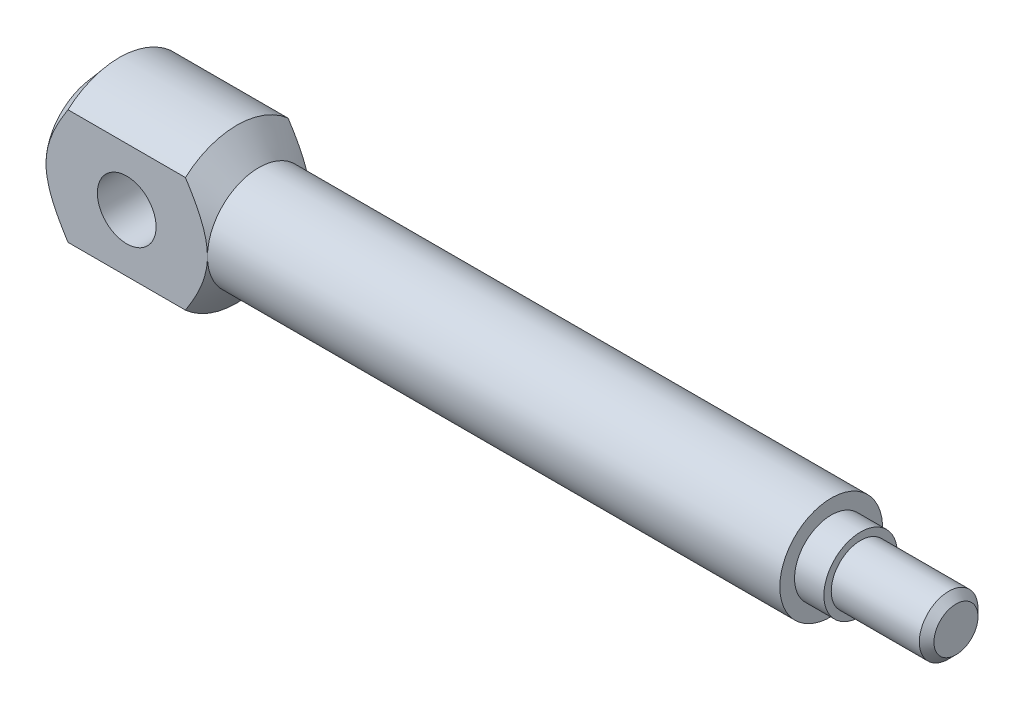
from build123d import *

# Parameters (mm, degrees)
ESQUISSE3_W             = 50
ESQUISSE3_H             = 40
ENL_V_MAT_EXTRU_2_DEPTH = 10
ESQUISSE4_W             = 50
ESQUISSE4_H             = 40
ENL_V_MAT_EXTRU_4_DEPTH = 10
ESQUISSE6_R             = 4
ENL_V_MAT_EXTRU_5_DEPTH = 119.301521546
CHANFREIN1_SIZE         = 1


with BuildPart() as part:
    # Esquisse1 → Base-R_volution (revolve)
    with BuildSketch(Plane.XY, mode=Mode.PRIVATE) as base_r_volution_sk:
        Polygon((0, 0), (117, 0), (117, 4), (104, 4), (104, 5), (100, 5), (100, 7), (22, 7), (19, 10.5), (3, 10.5), (0, 7), align=None)
    revolve(base_r_volution_sk.sketch.rotate(Axis((-40, 0, 0), (1, 0, 0)), 90), axis=Axis((-40, 0, 0), (1, 0, 0)))

    # Esquisse3 → Enl_v. mat.-Extru.2 (cut)
    with BuildSketch(Plane.XY.offset(7)):
        with Locations((15, 0)):
            Rectangle(ESQUISSE3_W, ESQUISSE3_H)
    extrude(amount=ENL_V_MAT_EXTRU_2_DEPTH, mode=Mode.SUBTRACT)

    # Esquisse4 → Enl_v. mat.-Extru.4 (cut)
    with BuildSketch(Plane.XY.offset(-7)):
        with Locations((15, 0)):
            Rectangle(ESQUISSE4_W, ESQUISSE4_H)
    extrude(amount=-ENL_V_MAT_EXTRU_4_DEPTH, mode=Mode.SUBTRACT)

    # Esquisse6 → Enl_v. mat.-Extru.5 (cut, through all)
    with BuildSketch(Plane.XY.offset(7)):
        with Locations((11, 0)):
            Circle(ESQUISSE6_R)
    extrude(amount=-ENL_V_MAT_EXTRU_5_DEPTH, mode=Mode.SUBTRACT)

    # Chanfrein1
    chanfrein1_edges = [part.edges().sort_by_distance(p)[0] for p in [
        (117, 0, -4),
    ]]
    chamfer(chanfrein1_edges, length=CHANFREIN1_SIZE)


solid = part.part
